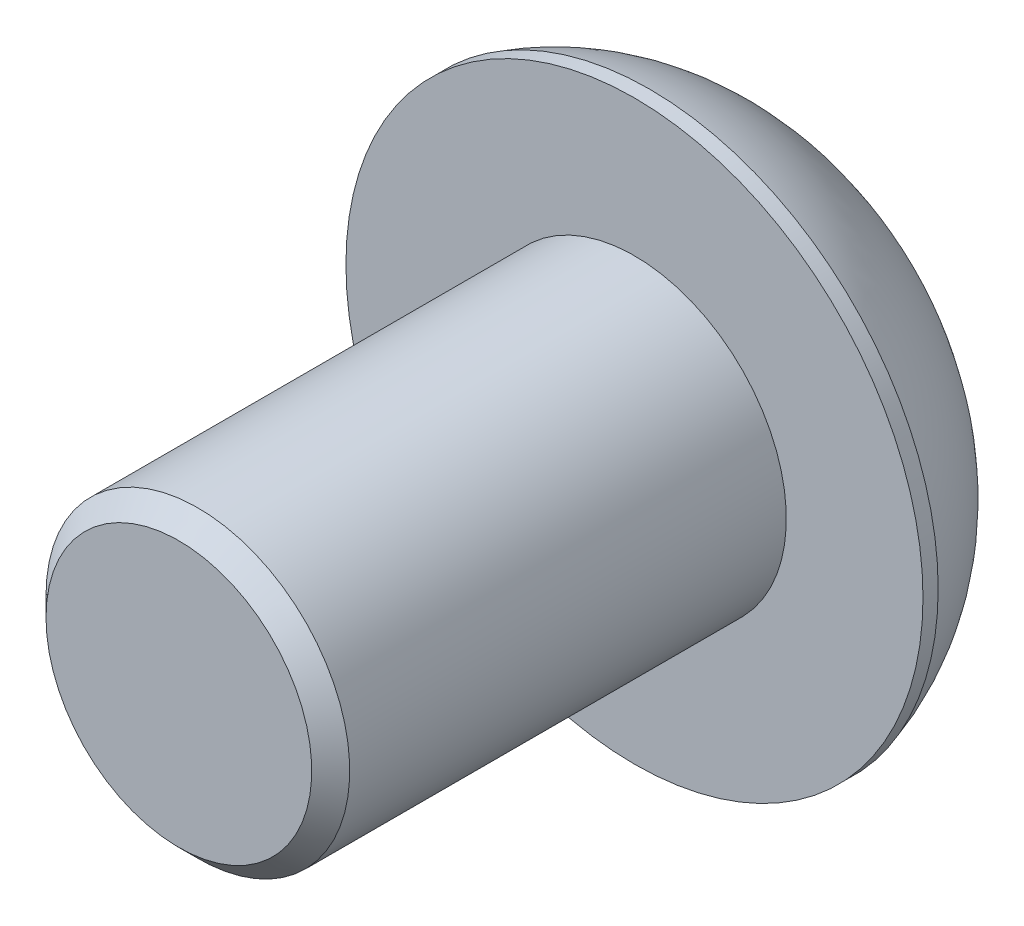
ISO-10303-21;
HEADER;
FILE_DESCRIPTION(('STEP AP214'),'2;1');
FILE_NAME('part.step','',(''),(''),'','','');
FILE_SCHEMA(('AUTOMOTIVE_DESIGN { 1 0 10303 214 1 1 1 1 }'));
ENDSEC;
DATA;
#1=APPLICATION_CONTEXT('core data for automotive mechanical design processes');
#2=APPLICATION_PROTOCOL_DEFINITION('international standard','automotive_design',2000,#1);
#3=PRODUCT_CONTEXT('',#1,'mechanical');
#4=PRODUCT('Part','Part','',(#3));
#5=PRODUCT_RELATED_PRODUCT_CATEGORY('part','',(#4));
#6=PRODUCT_DEFINITION_FORMATION('','',#4);
#7=PRODUCT_DEFINITION_CONTEXT('part definition',#1,'design');
#8=PRODUCT_DEFINITION('design','',#6,#7);
#9=PRODUCT_DEFINITION_SHAPE('','',#8);
#10=(LENGTH_UNIT() NAMED_UNIT(*) SI_UNIT(.MILLI.,.METRE.));
#11=(NAMED_UNIT(*) PLANE_ANGLE_UNIT() SI_UNIT($,.RADIAN.));
#12=(NAMED_UNIT(*) SI_UNIT($,.STERADIAN.) SOLID_ANGLE_UNIT());
#13=UNCERTAINTY_MEASURE_WITH_UNIT(LENGTH_MEASURE(1.E-05),#10,'distance_accuracy_value','');
#14=(GEOMETRIC_REPRESENTATION_CONTEXT(3) GLOBAL_UNCERTAINTY_ASSIGNED_CONTEXT((#13)) GLOBAL_UNIT_ASSIGNED_CONTEXT((#10,
#11,#12)) REPRESENTATION_CONTEXT('',''));
#15=CARTESIAN_POINT('',(0.,0.,0.));
#16=DIRECTION('',(0.,0.,1.));
#17=DIRECTION('',(1.,0.,0.));
#18=AXIS2_PLACEMENT_3D('',#15,#16,#17);
#19=CARTESIAN_POINT('',(0.,0.,6.));
#20=DIRECTION('',(0.,0.,-1.));
#21=DIRECTION('',(-1.,0.,0.));
#22=AXIS2_PLACEMENT_3D('',#19,#20,#21);
#23=CONICAL_SURFACE('',#22,1.75,0.78539816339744);
#24=CARTESIAN_POINT('',(0.,0.,5.74999999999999));
#25=DIRECTION('',(0.,0.,-1.));
#26=DIRECTION('',(-1.,0.,0.));
#27=AXIS2_PLACEMENT_3D('',#24,#25,#26);
#28=CIRCLE('',#27,2.);
#29=CARTESIAN_POINT('',(-2.,0.,5.74999999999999));
#30=VERTEX_POINT('',#29);
#31=EDGE_CURVE('E11',#30,#30,#28,.T.);
#32=ORIENTED_EDGE('',*,*,#31,.F.);
#33=EDGE_LOOP('',(#32));
#34=FACE_BOUND('',#33,.T.);
#35=CARTESIAN_POINT('',(0.,0.,6.));
#36=DIRECTION('',(0.,0.,-1.));
#37=DIRECTION('',(-1.,0.,0.));
#38=AXIS2_PLACEMENT_3D('',#35,#36,#37);
#39=CIRCLE('',#38,1.75);
#40=CARTESIAN_POINT('',(-1.75,0.,6.));
#41=VERTEX_POINT('',#40);
#42=EDGE_CURVE('E133',#41,#41,#39,.T.);
#43=ORIENTED_EDGE('',*,*,#42,.T.);
#44=EDGE_LOOP('',(#43));
#45=FACE_BOUND('',#44,.T.);
#46=ADVANCED_FACE('F32',(#34,#45),#23,.T.);
#47=CARTESIAN_POINT('',(0.,0.,0.));
#48=DIRECTION('',(0.,0.,-1.));
#49=DIRECTION('',(-1.,0.,0.));
#50=AXIS2_PLACEMENT_3D('',#47,#48,#49);
#51=CYLINDRICAL_SURFACE('',#50,2.);
#52=CARTESIAN_POINT('',(0.,0.,0.));
#53=DIRECTION('',(0.,0.,-1.));
#54=DIRECTION('',(-1.,0.,0.));
#55=AXIS2_PLACEMENT_3D('',#52,#53,#54);
#56=CIRCLE('',#55,2.);
#57=CARTESIAN_POINT('',(-2.,0.,0.));
#58=VERTEX_POINT('',#57);
#59=EDGE_CURVE('E39',#58,#58,#56,.T.);
#60=ORIENTED_EDGE('',*,*,#59,.F.);
#61=EDGE_LOOP('',(#60));
#62=FACE_BOUND('',#61,.T.);
#63=ORIENTED_EDGE('',*,*,#31,.T.);
#64=EDGE_LOOP('',(#63));
#65=FACE_BOUND('',#64,.T.);
#66=ADVANCED_FACE('F154',(#62,#65),#51,.T.);
#67=CARTESIAN_POINT('',(3.8,0.,0.));
#68=DIRECTION('',(0.,0.,-1.));
#69=DIRECTION('',(-1.,0.,0.));
#70=AXIS2_PLACEMENT_3D('',#67,#68,#69);
#71=PLANE('',#70);
#72=CARTESIAN_POINT('',(0.,0.,0.));
#73=DIRECTION('',(0.,0.,-1.));
#74=DIRECTION('',(-1.,0.,0.));
#75=AXIS2_PLACEMENT_3D('',#72,#73,#74);
#76=CIRCLE('',#75,3.8);
#77=CARTESIAN_POINT('',(-3.8,0.,0.));
#78=VERTEX_POINT('',#77);
#79=EDGE_CURVE('E147',#78,#78,#76,.T.);
#80=ORIENTED_EDGE('',*,*,#79,.F.);
#81=EDGE_LOOP('',(#80));
#82=FACE_BOUND('',#81,.T.);
#83=ORIENTED_EDGE('',*,*,#59,.T.);
#84=EDGE_LOOP('',(#83));
#85=FACE_BOUND('',#84,.T.);
#86=ADVANCED_FACE('F152',(#82,#85),#71,.F.);
#87=CARTESIAN_POINT('',(0.,0.,0.));
#88=DIRECTION('',(0.,0.,-1.));
#89=DIRECTION('',(-1.,0.,0.));
#90=AXIS2_PLACEMENT_3D('',#87,#88,#89);
#91=CYLINDRICAL_SURFACE('',#90,3.8);
#92=CARTESIAN_POINT('',(0.,0.,-0.2));
#93=DIRECTION('',(0.,0.,-1.));
#94=DIRECTION('',(-1.,0.,0.));
#95=AXIS2_PLACEMENT_3D('',#92,#93,#94);
#96=CIRCLE('',#95,3.8);
#97=CARTESIAN_POINT('',(-3.8,0.,-0.199999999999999));
#98=VERTEX_POINT('',#97);
#99=EDGE_CURVE('E144',#98,#98,#96,.T.);
#100=ORIENTED_EDGE('',*,*,#99,.F.);
#101=EDGE_LOOP('',(#100));
#102=FACE_BOUND('',#101,.T.);
#103=ORIENTED_EDGE('',*,*,#79,.T.);
#104=EDGE_LOOP('',(#103));
#105=FACE_BOUND('',#104,.T.);
#106=ADVANCED_FACE('F181',(#102,#105),#91,.T.);
#107=CARTESIAN_POINT('',(0.,0.,0.634906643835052));
#108=DIRECTION('',(0.,0.,-1.));
#109=DIRECTION('',(-1.,0.,0.));
#110=AXIS2_PLACEMENT_3D('',#107,#108,#109);
#111=DEGENERATE_TOROIDAL_SURFACE('',#110,0.918519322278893,3.,.T.);
#112=CARTESIAN_POINT('',(0.,0.,-2.2));
#113=DIRECTION('',(0.,0.,-1.));
#114=DIRECTION('',(-1.,0.,0.));
#115=AXIS2_PLACEMENT_3D('',#112,#113,#114);
#116=CIRCLE('',#115,1.9);
#117=CARTESIAN_POINT('',(-1.9,0.,-2.2));
#118=VERTEX_POINT('',#117);
#119=EDGE_CURVE('E141',#118,#118,#116,.T.);
#120=ORIENTED_EDGE('',*,*,#119,.F.);
#121=EDGE_LOOP('',(#120));
#122=FACE_BOUND('',#121,.T.);
#123=ORIENTED_EDGE('',*,*,#99,.T.);
#124=EDGE_LOOP('',(#123));
#125=FACE_BOUND('',#124,.T.);
#126=ADVANCED_FACE('F174',(#122,#125),#111,.T.);
#127=CARTESIAN_POINT('',(1.9,0.,-2.2));
#128=DIRECTION('',(0.,0.,1.));
#129=DIRECTION('',(1.,0.,0.));
#130=AXIS2_PLACEMENT_3D('',#127,#128,#129);
#131=PLANE('',#130);
#132=DIRECTION('',(0.5,0.866025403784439,0.));
#133=VECTOR('',#132,1.);
#134=CARTESIAN_POINT('',(-1.44337567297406,0.,-2.2));
#135=LINE('',#134,#133);
#136=CARTESIAN_POINT('',(-1.44337567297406,0.,-2.2));
#137=VERTEX_POINT('',#136);
#138=CARTESIAN_POINT('',(-0.721687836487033,1.25,-2.2));
#139=VERTEX_POINT('',#138);
#140=EDGE_CURVE('E120',#137,#139,#135,.T.);
#141=ORIENTED_EDGE('',*,*,#140,.F.);
#142=DIRECTION('',(-0.499999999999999,0.866025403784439,0.));
#143=VECTOR('',#142,1.);
#144=CARTESIAN_POINT('',(-0.721687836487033,-1.25,-2.2));
#145=LINE('',#144,#143);
#146=CARTESIAN_POINT('',(-0.721687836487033,-1.25,-2.2));
#147=VERTEX_POINT('',#146);
#148=EDGE_CURVE('E46',#147,#137,#145,.T.);
#149=ORIENTED_EDGE('',*,*,#148,.F.);
#150=DIRECTION('',(-1.,0.,0.));
#151=VECTOR('',#150,1.);
#152=CARTESIAN_POINT('',(0.721687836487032,-1.25,-2.2));
#153=LINE('',#152,#151);
#154=CARTESIAN_POINT('',(0.721687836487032,-1.25,-2.2));
#155=VERTEX_POINT('',#154);
#156=EDGE_CURVE('E129',#155,#147,#153,.T.);
#157=ORIENTED_EDGE('',*,*,#156,.F.);
#158=DIRECTION('',(-0.5,-0.866025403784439,0.));
#159=VECTOR('',#158,1.);
#160=CARTESIAN_POINT('',(1.44337567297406,0.,-2.2));
#161=LINE('',#160,#159);
#162=CARTESIAN_POINT('',(1.44337567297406,0.,-2.2));
#163=VERTEX_POINT('',#162);
#164=EDGE_CURVE('E127',#163,#155,#161,.T.);
#165=ORIENTED_EDGE('',*,*,#164,.F.);
#166=DIRECTION('',(0.5,-0.866025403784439,0.));
#167=VECTOR('',#166,1.);
#168=CARTESIAN_POINT('',(0.721687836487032,1.25,-2.2));
#169=LINE('',#168,#167);
#170=CARTESIAN_POINT('',(0.721687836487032,1.25,-2.2));
#171=VERTEX_POINT('',#170);
#172=EDGE_CURVE('E94',#171,#163,#169,.T.);
#173=ORIENTED_EDGE('',*,*,#172,.F.);
#174=DIRECTION('',(1.,0.,0.));
#175=VECTOR('',#174,1.);
#176=CARTESIAN_POINT('',(-0.721687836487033,1.25,-2.2));
#177=LINE('',#176,#175);
#178=EDGE_CURVE('E123',#139,#171,#177,.T.);
#179=ORIENTED_EDGE('',*,*,#178,.F.);
#180=EDGE_LOOP('',(#141,#149,#157,#165,#173,#179));
#181=FACE_BOUND('',#180,.T.);
#182=ORIENTED_EDGE('',*,*,#119,.T.);
#183=EDGE_LOOP('',(#182));
#184=FACE_BOUND('',#183,.T.);
#185=ADVANCED_FACE('F166',(#181,#184),#131,.F.);
#186=CARTESIAN_POINT('',(0.,0.,6.));
#187=DIRECTION('',(0.,0.,-1.));
#188=DIRECTION('',(-1.,0.,0.));
#189=AXIS2_PLACEMENT_3D('',#186,#187,#188);
#190=PLANE('',#189);
#191=ORIENTED_EDGE('',*,*,#42,.F.);
#192=EDGE_LOOP('',(#191));
#193=FACE_BOUND('',#192,.T.);
#194=ADVANCED_FACE('F163',(#193),#190,.F.);
#195=CARTESIAN_POINT('',(-0.721687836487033,-1.25,-0.95));
#196=DIRECTION('',(-0.866025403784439,-0.499999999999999,0.));
#197=DIRECTION('',(0.499999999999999,-0.866025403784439,0.));
#198=AXIS2_PLACEMENT_3D('',#195,#196,#197);
#199=PLANE('',#198);
#200=ORIENTED_EDGE('',*,*,#148,.T.);
#201=DIRECTION('',(0.,0.,-1.));
#202=VECTOR('',#201,1.);
#203=CARTESIAN_POINT('',(-1.44337567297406,0.,-0.95));
#204=LINE('',#203,#202);
#205=CARTESIAN_POINT('',(-1.44337567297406,0.,-0.95));
#206=VERTEX_POINT('',#205);
#207=EDGE_CURVE('E76',#206,#137,#204,.T.);
#208=ORIENTED_EDGE('',*,*,#207,.F.);
#209=DIRECTION('',(-0.499999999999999,0.866025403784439,0.));
#210=VECTOR('',#209,1.);
#211=CARTESIAN_POINT('',(-0.721687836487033,-1.25,-0.95));
#212=LINE('',#211,#210);
#213=CARTESIAN_POINT('',(-0.721687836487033,-1.25,-0.95));
#214=VERTEX_POINT('',#213);
#215=EDGE_CURVE('E131',#214,#206,#212,.T.);
#216=ORIENTED_EDGE('',*,*,#215,.F.);
#217=DIRECTION('',(0.,0.,-1.));
#218=VECTOR('',#217,1.);
#219=CARTESIAN_POINT('',(-0.721687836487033,-1.25,-0.95));
#220=LINE('',#219,#218);
#221=EDGE_CURVE('E54',#214,#147,#220,.T.);
#222=ORIENTED_EDGE('',*,*,#221,.T.);
#223=EDGE_LOOP('',(#200,#208,#216,#222));
#224=FACE_BOUND('',#223,.T.);
#225=ADVANCED_FACE('F165',(#224),#199,.F.);
#226=CARTESIAN_POINT('',(0.721687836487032,-1.25,-0.95));
#227=DIRECTION('',(0.,-1.,0.));
#228=DIRECTION('',(0.,0.,-1.));
#229=AXIS2_PLACEMENT_3D('',#226,#227,#228);
#230=PLANE('',#229);
#231=ORIENTED_EDGE('',*,*,#156,.T.);
#232=ORIENTED_EDGE('',*,*,#221,.F.);
#233=DIRECTION('',(-1.,0.,0.));
#234=VECTOR('',#233,1.);
#235=CARTESIAN_POINT('',(0.721687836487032,-1.25,-0.95));
#236=LINE('',#235,#234);
#237=CARTESIAN_POINT('',(0.721687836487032,-1.25,-0.95));
#238=VERTEX_POINT('',#237);
#239=EDGE_CURVE('E106',#238,#214,#236,.T.);
#240=ORIENTED_EDGE('',*,*,#239,.F.);
#241=DIRECTION('',(0.,0.,-1.));
#242=VECTOR('',#241,1.);
#243=CARTESIAN_POINT('',(0.721687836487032,-1.25,-0.95));
#244=LINE('',#243,#242);
#245=EDGE_CURVE('E98',#238,#155,#244,.T.);
#246=ORIENTED_EDGE('',*,*,#245,.T.);
#247=EDGE_LOOP('',(#231,#232,#240,#246));
#248=FACE_BOUND('',#247,.T.);
#249=ADVANCED_FACE('F172',(#248),#230,.F.);
#250=CARTESIAN_POINT('',(1.44337567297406,0.,-0.95));
#251=DIRECTION('',(0.866025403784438,-0.5,0.));
#252=DIRECTION('',(0.5,0.866025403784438,0.));
#253=AXIS2_PLACEMENT_3D('',#250,#251,#252);
#254=PLANE('',#253);
#255=ORIENTED_EDGE('',*,*,#164,.T.);
#256=ORIENTED_EDGE('',*,*,#245,.F.);
#257=DIRECTION('',(-0.5,-0.866025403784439,0.));
#258=VECTOR('',#257,1.);
#259=CARTESIAN_POINT('',(1.44337567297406,0.,-0.95));
#260=LINE('',#259,#258);
#261=CARTESIAN_POINT('',(1.44337567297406,0.,-0.95));
#262=VERTEX_POINT('',#261);
#263=EDGE_CURVE('E102',#262,#238,#260,.T.);
#264=ORIENTED_EDGE('',*,*,#263,.F.);
#265=DIRECTION('',(0.,0.,-1.));
#266=VECTOR('',#265,1.);
#267=CARTESIAN_POINT('',(1.44337567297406,0.,-0.95));
#268=LINE('',#267,#266);
#269=EDGE_CURVE('E87',#262,#163,#268,.T.);
#270=ORIENTED_EDGE('',*,*,#269,.T.);
#271=EDGE_LOOP('',(#255,#256,#264,#270));
#272=FACE_BOUND('',#271,.T.);
#273=ADVANCED_FACE('F103',(#272),#254,.F.);
#274=CARTESIAN_POINT('',(0.721687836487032,1.25,-0.95));
#275=DIRECTION('',(0.866025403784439,0.5,0.));
#276=DIRECTION('',(-0.5,0.866025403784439,0.));
#277=AXIS2_PLACEMENT_3D('',#274,#275,#276);
#278=PLANE('',#277);
#279=ORIENTED_EDGE('',*,*,#172,.T.);
#280=ORIENTED_EDGE('',*,*,#269,.F.);
#281=DIRECTION('',(0.5,-0.866025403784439,0.));
#282=VECTOR('',#281,1.);
#283=CARTESIAN_POINT('',(0.721687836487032,1.25,-0.95));
#284=LINE('',#283,#282);
#285=CARTESIAN_POINT('',(0.721687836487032,1.25,-0.95));
#286=VERTEX_POINT('',#285);
#287=EDGE_CURVE('E91',#286,#262,#284,.T.);
#288=ORIENTED_EDGE('',*,*,#287,.F.);
#289=DIRECTION('',(0.,0.,-1.));
#290=VECTOR('',#289,1.);
#291=CARTESIAN_POINT('',(0.721687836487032,1.25,-0.95));
#292=LINE('',#291,#290);
#293=EDGE_CURVE('E99',#286,#171,#292,.T.);
#294=ORIENTED_EDGE('',*,*,#293,.T.);
#295=EDGE_LOOP('',(#279,#280,#288,#294));
#296=FACE_BOUND('',#295,.T.);
#297=ADVANCED_FACE('F89',(#296),#278,.F.);
#298=CARTESIAN_POINT('',(-0.721687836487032,1.25,-0.95));
#299=DIRECTION('',(0.,1.,0.));
#300=DIRECTION('',(0.,0.,1.));
#301=AXIS2_PLACEMENT_3D('',#298,#299,#300);
#302=PLANE('',#301);
#303=ORIENTED_EDGE('',*,*,#178,.T.);
#304=ORIENTED_EDGE('',*,*,#293,.F.);
#305=DIRECTION('',(1.,0.,0.));
#306=VECTOR('',#305,1.);
#307=CARTESIAN_POINT('',(-0.721687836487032,1.25,-0.95));
#308=LINE('',#307,#306);
#309=CARTESIAN_POINT('',(-0.721687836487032,1.25,-0.95));
#310=VERTEX_POINT('',#309);
#311=EDGE_CURVE('E112',#310,#286,#308,.T.);
#312=ORIENTED_EDGE('',*,*,#311,.F.);
#313=DIRECTION('',(0.,0.,-1.));
#314=VECTOR('',#313,1.);
#315=CARTESIAN_POINT('',(-0.721687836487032,1.25,-0.95));
#316=LINE('',#315,#314);
#317=EDGE_CURVE('E136',#310,#139,#316,.T.);
#318=ORIENTED_EDGE('',*,*,#317,.T.);
#319=EDGE_LOOP('',(#303,#304,#312,#318));
#320=FACE_BOUND('',#319,.T.);
#321=ADVANCED_FACE('F239',(#320),#302,.F.);
#322=CARTESIAN_POINT('',(-1.44337567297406,0.,-0.95));
#323=DIRECTION('',(-0.866025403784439,0.5,0.));
#324=DIRECTION('',(-0.5,-0.866025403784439,0.));
#325=AXIS2_PLACEMENT_3D('',#322,#323,#324);
#326=PLANE('',#325);
#327=ORIENTED_EDGE('',*,*,#140,.T.);
#328=ORIENTED_EDGE('',*,*,#317,.F.);
#329=DIRECTION('',(0.5,0.866025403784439,0.));
#330=VECTOR('',#329,1.);
#331=CARTESIAN_POINT('',(-1.44337567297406,0.,-0.95));
#332=LINE('',#331,#330);
#333=EDGE_CURVE('E114',#206,#310,#332,.T.);
#334=ORIENTED_EDGE('',*,*,#333,.F.);
#335=ORIENTED_EDGE('',*,*,#207,.T.);
#336=EDGE_LOOP('',(#327,#328,#334,#335));
#337=FACE_BOUND('',#336,.T.);
#338=ADVANCED_FACE('F248',(#337),#326,.F.);
#339=CARTESIAN_POINT('',(-1.44337567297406,0.,-0.95));
#340=DIRECTION('',(0.,0.,-1.));
#341=DIRECTION('',(-1.,0.,0.));
#342=AXIS2_PLACEMENT_3D('',#339,#340,#341);
#343=PLANE('',#342);
#344=ORIENTED_EDGE('',*,*,#215,.T.);
#345=ORIENTED_EDGE('',*,*,#333,.T.);
#346=ORIENTED_EDGE('',*,*,#311,.T.);
#347=ORIENTED_EDGE('',*,*,#287,.T.);
#348=ORIENTED_EDGE('',*,*,#263,.T.);
#349=ORIENTED_EDGE('',*,*,#239,.T.);
#350=EDGE_LOOP('',(#344,#345,#346,#347,#348,#349));
#351=FACE_BOUND('',#350,.T.);
#352=ADVANCED_FACE('F109',(#351),#343,.T.);
#353=CLOSED_SHELL('',(#46,#66,#86,#106,#126,#185,#194,#225,#249,#273,#297,#321,#338,#352));
#354=MANIFOLD_SOLID_BREP('B2',#353);
#355=ADVANCED_BREP_SHAPE_REPRESENTATION('',(#18,#354),#14);
#356=SHAPE_DEFINITION_REPRESENTATION(#9,#355);
ENDSEC;
END-ISO-10303-21;
